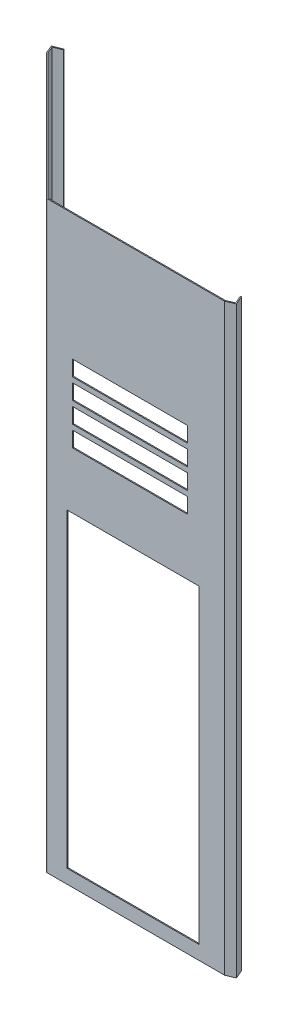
from build123d import *

# Parameters (mm, degrees)
EXTRU_MINCE1_DEPTH      = 2276
CONG_1_R                = 4
CONG_2_R                = 2
ESQUISSE2_W             = 514
ESQUISSE2_H             = 1210
ESQUISSE2_W_2           = 450
ESQUISSE2_H_2           = 60
ENL_V_MAT_EXTRU_1_DEPTH = 2629.436138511
ESQUISSE3_W             = 430
ESQUISSE3_H             = 665
ESQUISSE3_W_2           = 450
ESQUISSE3_H_2           = 60
ENL_V_MAT_EXTRU_2_DEPTH = 2587.599860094


with BuildPart() as part:
    # Esquisse1 → Extru.-Mince1 (new body)
    with BuildSketch(Plane(origin=(0, 0, 0), x_dir=(1, 0, 0), z_dir=(0, 1, 0))):
        Polygon((17.369886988, 48.654773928), (32.217669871, 13.675589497), (0, 0), (-695, 0), (-1186.439212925, 491.439212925), (-1199.550443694, 523.890647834), (-1164.317457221, 538.125698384), (-1162.819030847, 534.416962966), (-1194.343281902, 521.68033879), (-1183.035335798, 493.692190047), (-693.343145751, 4), (-0.813809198, 4), (26.972725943, 15.794684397), (13.687867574, 47.091849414), align=None)
    extrude(amount=EXTRU_MINCE1_DEPTH)

    # Cong_1
    cong_1_edges = [part.edges().sort_by_distance(p)[0] for p in [
        (-695, 1138, 0),
    ]]
    fillet(cong_1_edges, radius=CONG_1_R)

    # Cong_2
    cong_2_edges = [part.edges().sort_by_distance(p)[0] for p in [
        (-693.343145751, 1138, -4),
    ]]
    fillet(cong_2_edges, radius=CONG_2_R)

    # Esquisse2 → Enl_v. mat.-Extru.1 (cut, through all)
    with BuildSketch(Plane.XY):
        with Locations((-357, 659)):
            Rectangle(ESQUISSE2_W, ESQUISSE2_H)
        with Locations((-369, 1754)):
            Rectangle(ESQUISSE2_W_2, ESQUISSE2_H_2)
        with Locations((-369, 1514)):
            Rectangle(ESQUISSE2_W_2, ESQUISSE2_H_2)
        with Locations((-369, 1674)):
            Rectangle(ESQUISSE2_W_2, ESQUISSE2_H_2)
        with Locations((-369, 1594)):
            Rectangle(ESQUISSE2_W_2, ESQUISSE2_H_2)
    extrude(amount=-ENL_V_MAT_EXTRU_1_DEPTH, mode=Mode.SUBTRACT)

    # Esquisse3 → Enl_v. mat.-Extru.2 (cut, through all)
    with BuildSketch(Plane(origin=(-347.5, 0, 347.5), x_dir=(0.7071067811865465, 0, 0.7071067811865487), z_dir=(-0.7071067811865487, 0, 0.7071067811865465))):
        with Locations((-764.439212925, 332.5)):
            Rectangle(ESQUISSE3_W, ESQUISSE3_H)
        with Locations((-817.439212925, 1554)):
            Rectangle(ESQUISSE3_W_2, ESQUISSE3_H_2)
        with Locations((-817.439212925, 1474)):
            Rectangle(ESQUISSE3_W_2, ESQUISSE3_H_2)
        with Locations((-817.439212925, 1394)):
            Rectangle(ESQUISSE3_W_2, ESQUISSE3_H_2)
        with Locations((-817.439212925, 1314)):
            Rectangle(ESQUISSE3_W_2, ESQUISSE3_H_2)
        with Locations((-817.439212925, 1234)):
            Rectangle(ESQUISSE3_W_2, ESQUISSE3_H_2)
    extrude(amount=-ENL_V_MAT_EXTRU_2_DEPTH, mode=Mode.SUBTRACT)


solid = part.part
